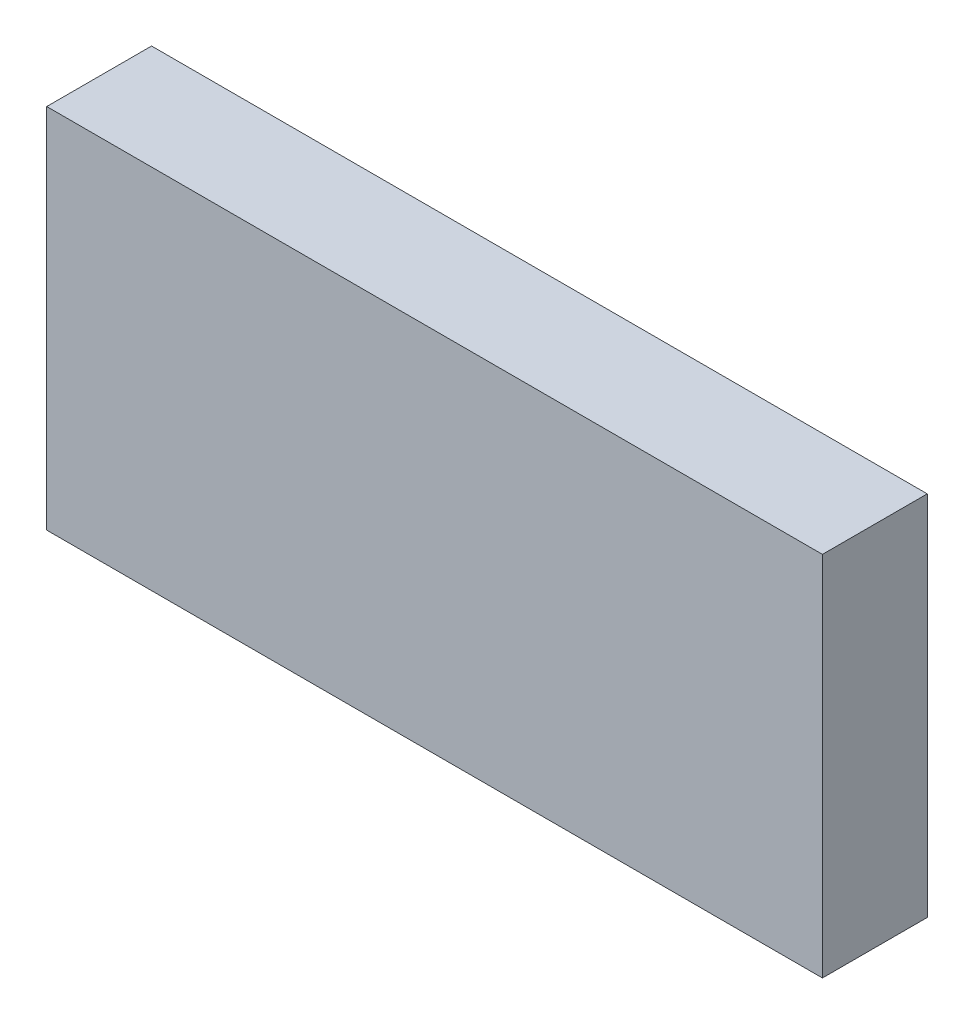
from build123d import *

# Parameters (mm, degrees)
SKETCH1_W           = 2
SKETCH1_H           = 7
BOSS_EXTRUDE1_DEPTH = 14.8


with BuildPart() as part:
    # Sketch1 → Boss-Extrude1 (new body)
    with BuildSketch(Plane(origin=(703.583537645, 0, 0), x_dir=(0, 0, -1), z_dir=(1, 0, 0))):
        with Locations((-1418.189266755, 958.282671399)):
            Rectangle(SKETCH1_W, SKETCH1_H)
    extrude(amount=BOSS_EXTRUDE1_DEPTH)


solid = part.part
